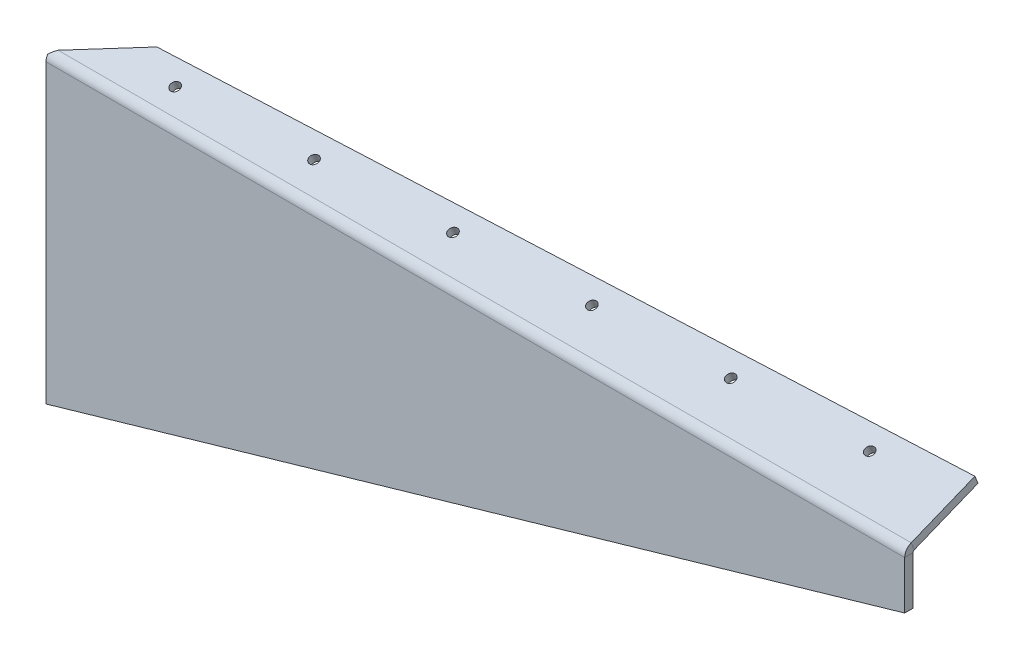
ISO-10303-21;
HEADER;
FILE_DESCRIPTION(('STEP AP214'),'2;1');
FILE_NAME('part.step','',(''),(''),'','','');
FILE_SCHEMA(('AUTOMOTIVE_DESIGN { 1 0 10303 214 1 1 1 1 }'));
ENDSEC;
DATA;
#1=APPLICATION_CONTEXT('core data for automotive mechanical design processes');
#2=APPLICATION_PROTOCOL_DEFINITION('international standard','automotive_design',2000,#1);
#3=PRODUCT_CONTEXT('',#1,'mechanical');
#4=PRODUCT('Part','Part','',(#3));
#5=PRODUCT_RELATED_PRODUCT_CATEGORY('part','',(#4));
#6=PRODUCT_DEFINITION_FORMATION('','',#4);
#7=PRODUCT_DEFINITION_CONTEXT('part definition',#1,'design');
#8=PRODUCT_DEFINITION('design','',#6,#7);
#9=PRODUCT_DEFINITION_SHAPE('','',#8);
#10=(LENGTH_UNIT() NAMED_UNIT(*) SI_UNIT(.MILLI.,.METRE.));
#11=(NAMED_UNIT(*) PLANE_ANGLE_UNIT() SI_UNIT($,.RADIAN.));
#12=(NAMED_UNIT(*) SI_UNIT($,.STERADIAN.) SOLID_ANGLE_UNIT());
#13=UNCERTAINTY_MEASURE_WITH_UNIT(LENGTH_MEASURE(1.E-05),#10,'distance_accuracy_value','');
#14=(GEOMETRIC_REPRESENTATION_CONTEXT(3) GLOBAL_UNCERTAINTY_ASSIGNED_CONTEXT((#13)) GLOBAL_UNIT_ASSIGNED_CONTEXT((#10,
#11,#12)) REPRESENTATION_CONTEXT('',''));
#15=CARTESIAN_POINT('',(0.,0.,0.));
#16=DIRECTION('',(0.,0.,1.));
#17=DIRECTION('',(1.,0.,0.));
#18=AXIS2_PLACEMENT_3D('',#15,#16,#17);
#19=CARTESIAN_POINT('',(830.,-21.770209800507,48.4096177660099));
#20=DIRECTION('',(0.,-0.927183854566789,-0.37460659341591));
#21=DIRECTION('',(-1.,0.,0.));
#22=AXIS2_PLACEMENT_3D('',#19,#20,#21);
#23=PLANE('',#22);
#24=CARTESIAN_POINT('',(749.575825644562,14.5966140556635,-41.6014298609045));
#25=DIRECTION('',(0.,-0.927183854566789,-0.37460659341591));
#26=DIRECTION('',(0.,0.37460659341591,-0.927183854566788));
#27=AXIS2_PLACEMENT_3D('',#24,#25,#26);
#28=CIRCLE('',#27,4.5);
#29=CARTESIAN_POINT('',(749.575825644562,16.2823437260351,-45.7737572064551));
#30=VERTEX_POINT('',#29);
#31=EDGE_CURVE('E462',#30,#30,#28,.T.);
#32=ORIENTED_EDGE('',*,*,#31,.F.);
#33=EDGE_LOOP('',(#32));
#34=FACE_BOUND('',#33,.T.);
#35=CARTESIAN_POINT('',(619.66066051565,12.8375630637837,-37.247625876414));
#36=DIRECTION('',(0.,-0.927183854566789,-0.37460659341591));
#37=DIRECTION('',(0.,0.37460659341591,-0.927183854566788));
#38=AXIS2_PLACEMENT_3D('',#35,#36,#37);
#39=CIRCLE('',#38,4.5);
#40=CARTESIAN_POINT('',(619.66066051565,14.5232927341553,-41.4199532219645));
#41=VERTEX_POINT('',#40);
#42=EDGE_CURVE('E472',#41,#41,#39,.T.);
#43=ORIENTED_EDGE('',*,*,#42,.F.);
#44=EDGE_LOOP('',(#43));
#45=FACE_BOUND('',#44,.T.);
#46=CARTESIAN_POINT('',(489.745495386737,11.078512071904,-32.8938218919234));
#47=DIRECTION('',(0.,-0.927183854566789,-0.37460659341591));
#48=DIRECTION('',(0.,0.37460659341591,-0.927183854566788));
#49=AXIS2_PLACEMENT_3D('',#46,#47,#48);
#50=CIRCLE('',#49,4.5);
#51=CARTESIAN_POINT('',(489.745495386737,12.7642417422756,-37.0661492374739));
#52=VERTEX_POINT('',#51);
#53=EDGE_CURVE('E478',#52,#52,#50,.T.);
#54=ORIENTED_EDGE('',*,*,#53,.F.);
#55=EDGE_LOOP('',(#54));
#56=FACE_BOUND('',#55,.T.);
#57=CARTESIAN_POINT('',(359.830330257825,9.31946108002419,-28.5400179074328));
#58=DIRECTION('',(0.,-0.927183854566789,-0.37460659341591));
#59=DIRECTION('',(0.,0.37460659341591,-0.927183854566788));
#60=AXIS2_PLACEMENT_3D('',#57,#58,#59);
#61=CIRCLE('',#60,4.5);
#62=CARTESIAN_POINT('',(359.830330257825,11.0051907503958,-32.7123452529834));
#63=VERTEX_POINT('',#62);
#64=EDGE_CURVE('E484',#63,#63,#61,.T.);
#65=ORIENTED_EDGE('',*,*,#64,.F.);
#66=EDGE_LOOP('',(#65));
#67=FACE_BOUND('',#66,.T.);
#68=CARTESIAN_POINT('',(229.915165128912,7.5604100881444,-24.1862139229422));
#69=DIRECTION('',(0.,-0.927183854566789,-0.37460659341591));
#70=DIRECTION('',(0.,0.37460659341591,-0.927183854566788));
#71=AXIS2_PLACEMENT_3D('',#68,#69,#70);
#72=CIRCLE('',#71,4.5);
#73=CARTESIAN_POINT('',(229.915165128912,9.246139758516,-28.3585412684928));
#74=VERTEX_POINT('',#73);
#75=EDGE_CURVE('E490',#74,#74,#72,.T.);
#76=ORIENTED_EDGE('',*,*,#75,.F.);
#77=EDGE_LOOP('',(#76));
#78=FACE_BOUND('',#77,.T.);
#79=CARTESIAN_POINT('',(100.,5.80135909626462,-19.8324099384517));
#80=DIRECTION('',(0.,-0.927183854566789,-0.37460659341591));
#81=DIRECTION('',(0.,0.37460659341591,-0.927183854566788));
#82=AXIS2_PLACEMENT_3D('',#79,#80,#81);
#83=CIRCLE('',#82,4.5);
#84=CARTESIAN_POINT('',(100.,7.48708876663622,-24.0047372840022));
#85=VERTEX_POINT('',#84);
#86=EDGE_CURVE('E301',#85,#85,#83,.T.);
#87=ORIENTED_EDGE('',*,*,#86,.F.);
#88=EDGE_LOOP('',(#87));
#89=FACE_BOUND('',#88,.T.);
#90=DIRECTION('',(0.,0.37460659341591,-0.927183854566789));
#91=VECTOR('',#90,1.);
#92=CARTESIAN_POINT('',(830.,23.1825814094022,-62.8524447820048));
#93=LINE('',#92,#91);
#94=CARTESIAN_POINT('',(830.,-1.70610396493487,-1.2507868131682));
#95=VERTEX_POINT('',#94);
#96=CARTESIAN_POINT('',(830.,23.1825814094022,-62.8524447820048));
#97=VERTEX_POINT('',#96);
#98=EDGE_CURVE('E72',#95,#97,#93,.T.);
#99=ORIENTED_EDGE('',*,*,#98,.F.);
#100=DIRECTION('',(-1.,0.,0.));
#101=VECTOR('',#100,1.);
#102=CARTESIAN_POINT('',(830.,-1.70610396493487,-1.2507868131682));
#103=LINE('',#102,#101);
#104=CARTESIAN_POINT('',(5.46142375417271,-1.70610396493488,-1.25078681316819));
#105=VERTEX_POINT('',#104);
#106=EDGE_CURVE('E64',#95,#105,#103,.T.);
#107=ORIENTED_EDGE('',*,*,#106,.T.);
#108=DIRECTION('',(-0.837703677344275,-0.204582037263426,0.506358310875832));
#109=VECTOR('',#108,1.);
#110=CARTESIAN_POINT('',(64.9575825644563,12.8239091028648,-37.2138311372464));
#111=LINE('',#110,#109);
#112=CARTESIAN_POINT('',(64.9575825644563,12.8239091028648,-37.2138311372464));
#113=VERTEX_POINT('',#112);
#114=EDGE_CURVE('E80',#113,#105,#111,.T.);
#115=ORIENTED_EDGE('',*,*,#114,.F.);
#116=DIRECTION('',(-0.999347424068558,-0.0135311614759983,0.0334907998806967));
#117=VECTOR('',#116,1.);
#118=CARTESIAN_POINT('',(830.,23.1825814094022,-62.8524447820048));
#119=LINE('',#118,#117);
#120=EDGE_CURVE('E191',#97,#113,#119,.T.);
#121=ORIENTED_EDGE('',*,*,#120,.F.);
#122=EDGE_LOOP('',(#99,#107,#115,#121));
#123=FACE_BOUND('',#122,.T.);
#124=ADVANCED_FACE('F53',(#34,#45,#56,#67,#78,#89,#123),#23,.T.);
#125=CARTESIAN_POINT('',(830.,30.6000522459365,-59.8555920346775));
#126=DIRECTION('',(-1.,0.,0.));
#127=DIRECTION('',(0.,0.927183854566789,0.37460659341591));
#128=AXIS2_PLACEMENT_3D('',#125,#126,#127);
#129=PLANE('',#128);
#130=DIRECTION('',(0.,0.927183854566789,0.37460659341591));
#131=VECTOR('',#130,1.);
#132=CARTESIAN_POINT('',(830.,5.71136687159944,1.74606593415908));
#133=LINE('',#132,#131);
#134=CARTESIAN_POINT('',(830.,5.71136687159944,1.74606593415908));
#135=VERTEX_POINT('',#134);
#136=EDGE_CURVE('E12',#95,#135,#133,.T.);
#137=ORIENTED_EDGE('',*,*,#136,.F.);
#138=ORIENTED_EDGE('',*,*,#98,.T.);
#139=DIRECTION('',(0.,-0.927183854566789,-0.37460659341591));
#140=VECTOR('',#139,1.);
#141=CARTESIAN_POINT('',(830.,30.6000522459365,-59.8555920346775));
#142=LINE('',#141,#140);
#143=CARTESIAN_POINT('',(830.,30.6000522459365,-59.8555920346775));
#144=VERTEX_POINT('',#143);
#145=EDGE_CURVE('E195',#144,#97,#142,.T.);
#146=ORIENTED_EDGE('',*,*,#145,.F.);
#147=DIRECTION('',(0.,0.37460659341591,-0.927183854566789));
#148=VECTOR('',#147,1.);
#149=CARTESIAN_POINT('',(830.,30.6000522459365,-59.8555920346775));
#150=LINE('',#149,#148);
#151=EDGE_CURVE('E190',#135,#144,#150,.T.);
#152=ORIENTED_EDGE('',*,*,#151,.F.);
#153=EDGE_LOOP('',(#137,#138,#146,#152));
#154=FACE_BOUND('',#153,.T.);
#155=ADVANCED_FACE('F55',(#154),#129,.F.);
#156=CARTESIAN_POINT('',(830.,30.6000522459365,-59.8555920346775));
#157=DIRECTION('',(0.0361209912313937,-0.374362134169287,0.926578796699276));
#158=DIRECTION('',(0.999347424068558,0.0135311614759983,-0.0334907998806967));
#159=AXIS2_PLACEMENT_3D('',#156,#157,#158);
#160=PLANE('',#159);
#161=ORIENTED_EDGE('',*,*,#120,.T.);
#162=DIRECTION('',(0.,-0.927183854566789,-0.37460659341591));
#163=VECTOR('',#162,1.);
#164=CARTESIAN_POINT('',(64.9575825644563,20.2413799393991,-34.2169783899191));
#165=LINE('',#164,#163);
#166=CARTESIAN_POINT('',(64.9575825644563,20.2413799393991,-34.2169783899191));
#167=VERTEX_POINT('',#166);
#168=EDGE_CURVE('E193',#167,#113,#165,.T.);
#169=ORIENTED_EDGE('',*,*,#168,.F.);
#170=DIRECTION('',(-0.999347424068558,-0.0135311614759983,0.0334907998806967));
#171=VECTOR('',#170,1.);
#172=CARTESIAN_POINT('',(830.,30.6000522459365,-59.8555920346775));
#173=LINE('',#172,#171);
#174=EDGE_CURVE('E187',#144,#167,#173,.T.);
#175=ORIENTED_EDGE('',*,*,#174,.F.);
#176=ORIENTED_EDGE('',*,*,#145,.T.);
#177=EDGE_LOOP('',(#161,#169,#175,#176));
#178=FACE_BOUND('',#177,.T.);
#179=ADVANCED_FACE('F337',(#178),#160,.F.);
#180=CARTESIAN_POINT('',(64.9575825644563,20.2413799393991,-34.2169783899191));
#181=DIRECTION('',(0.546125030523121,-0.313809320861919,0.776705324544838));
#182=DIRECTION('',(0.837703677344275,0.204582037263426,-0.506358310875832));
#183=AXIS2_PLACEMENT_3D('',#180,#181,#182);
#184=PLANE('',#183);
#185=CARTESIAN_POINT('',(5.46142375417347,5.71136687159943,1.74606593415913));
#186=CARTESIAN_POINT('',(5.46142375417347,-1.70610396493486,-1.25078681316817));
#187=B_SPLINE_CURVE_WITH_KNOTS('',1,(#185,#186),.UNSPECIFIED.,.F.,.F.,(2,2),(0.,1.),.UNSPECIFIED.);
#188=CARTESIAN_POINT('',(5.46142375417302,5.71136687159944,1.74606593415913));
#189=VERTEX_POINT('',#188);
#190=EDGE_CURVE('E206',#189,#105,#187,.T.);
#191=ORIENTED_EDGE('',*,*,#190,.F.);
#192=DIRECTION('',(-0.837703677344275,-0.204582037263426,0.506358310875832));
#193=VECTOR('',#192,1.);
#194=CARTESIAN_POINT('',(64.9575825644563,20.2413799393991,-34.2169783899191));
#195=LINE('',#194,#193);
#196=EDGE_CURVE('E189',#167,#189,#195,.T.);
#197=ORIENTED_EDGE('',*,*,#196,.F.);
#198=ORIENTED_EDGE('',*,*,#168,.T.);
#199=ORIENTED_EDGE('',*,*,#114,.T.);
#200=EDGE_LOOP('',(#191,#197,#198,#199));
#201=FACE_BOUND('',#200,.T.);
#202=ADVANCED_FACE('F216',(#201),#184,.F.);
#203=CARTESIAN_POINT('',(830.,-14.3527389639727,51.4064705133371));
#204=DIRECTION('',(0.,-0.927183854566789,-0.37460659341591));
#205=DIRECTION('',(-1.,0.,0.));
#206=AXIS2_PLACEMENT_3D('',#203,#204,#205);
#207=PLANE('',#206);
#208=CARTESIAN_POINT('',(749.575825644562,22.0140848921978,-38.6045771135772));
#209=DIRECTION('',(0.,0.927183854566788,0.37460659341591));
#210=DIRECTION('',(0.,-0.37460659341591,0.927183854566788));
#211=AXIS2_PLACEMENT_3D('',#208,#209,#210);
#212=CIRCLE('',#211,4.5);
#213=CARTESIAN_POINT('',(749.575825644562,20.3283552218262,-34.4322497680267));
#214=VERTEX_POINT('',#213);
#215=EDGE_CURVE('E465',#214,#214,#212,.T.);
#216=ORIENTED_EDGE('',*,*,#215,.F.);
#217=EDGE_LOOP('',(#216));
#218=FACE_BOUND('',#217,.T.);
#219=CARTESIAN_POINT('',(619.66066051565,20.2550339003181,-34.2507731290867));
#220=DIRECTION('',(0.,0.927183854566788,0.37460659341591));
#221=DIRECTION('',(0.,-0.37460659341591,0.927183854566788));
#222=AXIS2_PLACEMENT_3D('',#219,#220,#221);
#223=CIRCLE('',#222,4.5);
#224=CARTESIAN_POINT('',(619.66066051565,18.5693042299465,-30.0784457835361));
#225=VERTEX_POINT('',#224);
#226=EDGE_CURVE('E467',#225,#225,#223,.T.);
#227=ORIENTED_EDGE('',*,*,#226,.F.);
#228=EDGE_LOOP('',(#227));
#229=FACE_BOUND('',#228,.T.);
#230=CARTESIAN_POINT('',(489.745495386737,18.4959829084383,-29.8969691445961));
#231=DIRECTION('',(0.,0.927183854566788,0.37460659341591));
#232=DIRECTION('',(0.,-0.37460659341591,0.927183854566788));
#233=AXIS2_PLACEMENT_3D('',#230,#231,#232);
#234=CIRCLE('',#233,4.5);
#235=CARTESIAN_POINT('',(489.745495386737,16.8102532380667,-25.7246417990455));
#236=VERTEX_POINT('',#235);
#237=EDGE_CURVE('E475',#236,#236,#234,.T.);
#238=ORIENTED_EDGE('',*,*,#237,.F.);
#239=EDGE_LOOP('',(#238));
#240=FACE_BOUND('',#239,.T.);
#241=CARTESIAN_POINT('',(359.830330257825,16.7369319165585,-25.5431651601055));
#242=DIRECTION('',(0.,0.927183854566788,0.37460659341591));
#243=DIRECTION('',(0.,-0.37460659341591,0.927183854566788));
#244=AXIS2_PLACEMENT_3D('',#241,#242,#243);
#245=CIRCLE('',#244,4.5);
#246=CARTESIAN_POINT('',(359.830330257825,15.0512022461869,-21.370837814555));
#247=VERTEX_POINT('',#246);
#248=EDGE_CURVE('E481',#247,#247,#245,.T.);
#249=ORIENTED_EDGE('',*,*,#248,.F.);
#250=EDGE_LOOP('',(#249));
#251=FACE_BOUND('',#250,.T.);
#252=CARTESIAN_POINT('',(229.915165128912,14.9778809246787,-21.1893611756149));
#253=DIRECTION('',(0.,0.927183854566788,0.37460659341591));
#254=DIRECTION('',(0.,-0.37460659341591,0.927183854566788));
#255=AXIS2_PLACEMENT_3D('',#252,#253,#254);
#256=CIRCLE('',#255,4.5);
#257=CARTESIAN_POINT('',(229.915165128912,13.2921512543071,-17.0170338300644));
#258=VERTEX_POINT('',#257);
#259=EDGE_CURVE('E487',#258,#258,#256,.T.);
#260=ORIENTED_EDGE('',*,*,#259,.F.);
#261=EDGE_LOOP('',(#260));
#262=FACE_BOUND('',#261,.T.);
#263=CARTESIAN_POINT('',(100.,13.2188299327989,-16.8355571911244));
#264=DIRECTION('',(0.,0.927183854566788,0.37460659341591));
#265=DIRECTION('',(0.,-0.37460659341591,0.927183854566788));
#266=AXIS2_PLACEMENT_3D('',#263,#264,#265);
#267=CIRCLE('',#266,4.5);
#268=CARTESIAN_POINT('',(100.,11.5331002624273,-12.6632298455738));
#269=VERTEX_POINT('',#268);
#270=EDGE_CURVE('E304',#269,#269,#267,.T.);
#271=ORIENTED_EDGE('',*,*,#270,.F.);
#272=EDGE_LOOP('',(#271));
#273=FACE_BOUND('',#272,.T.);
#274=DIRECTION('',(-1.,0.,0.));
#275=VECTOR('',#274,1.);
#276=CARTESIAN_POINT('',(830.,5.71136687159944,1.74606593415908));
#277=LINE('',#276,#275);
#278=EDGE_CURVE('E197',#135,#189,#277,.T.);
#279=ORIENTED_EDGE('',*,*,#278,.F.);
#280=ORIENTED_EDGE('',*,*,#151,.T.);
#281=ORIENTED_EDGE('',*,*,#174,.T.);
#282=ORIENTED_EDGE('',*,*,#196,.T.);
#283=EDGE_LOOP('',(#279,#280,#281,#282));
#284=FACE_BOUND('',#283,.T.);
#285=ADVANCED_FACE('F223',(#218,#229,#240,#251,#262,#273,#284),#207,.F.);
#286=CARTESIAN_POINT('',(0.,-290.,8.));
#287=DIRECTION('',(-0.277777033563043,0.960645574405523,0.));
#288=DIRECTION('',(-0.960645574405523,-0.277777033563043,0.));
#289=AXIS2_PLACEMENT_3D('',#286,#287,#288);
#290=PLANE('',#289);
#291=DIRECTION('',(0.960645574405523,0.277777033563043,0.));
#292=VECTOR('',#291,1.);
#293=CARTESIAN_POINT('',(0.,-290.,0.));
#294=LINE('',#293,#292);
#295=CARTESIAN_POINT('',(0.,-290.,0.));
#296=VERTEX_POINT('',#295);
#297=CARTESIAN_POINT('',(830.,-50.,0.));
#298=VERTEX_POINT('',#297);
#299=EDGE_CURVE('E181',#296,#298,#294,.T.);
#300=ORIENTED_EDGE('',*,*,#299,.T.);
#301=DIRECTION('',(0.,0.,-1.));
#302=VECTOR('',#301,1.);
#303=CARTESIAN_POINT('',(830.,-50.,8.));
#304=LINE('',#303,#302);
#305=CARTESIAN_POINT('',(830.,-50.,8.));
#306=VERTEX_POINT('',#305);
#307=EDGE_CURVE('E166',#306,#298,#304,.T.);
#308=ORIENTED_EDGE('',*,*,#307,.F.);
#309=DIRECTION('',(0.960645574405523,0.277777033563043,0.));
#310=VECTOR('',#309,1.);
#311=CARTESIAN_POINT('',(0.,-290.,8.));
#312=LINE('',#311,#310);
#313=CARTESIAN_POINT('',(0.,-290.,8.));
#314=VERTEX_POINT('',#313);
#315=EDGE_CURVE('E156',#314,#306,#312,.T.);
#316=ORIENTED_EDGE('',*,*,#315,.F.);
#317=DIRECTION('',(0.,0.,-1.));
#318=VECTOR('',#317,1.);
#319=CARTESIAN_POINT('',(0.,-290.,8.));
#320=LINE('',#319,#318);
#321=EDGE_CURVE('E160',#314,#296,#320,.T.);
#322=ORIENTED_EDGE('',*,*,#321,.T.);
#323=EDGE_LOOP('',(#300,#308,#316,#322));
#324=FACE_BOUND('',#323,.T.);
#325=ADVANCED_FACE('F345',(#324),#290,.F.);
#326=CARTESIAN_POINT('',(830.,-50.,8.));
#327=DIRECTION('',(0.,0.,-1.));
#328=DIRECTION('',(-1.,0.,0.));
#329=AXIS2_PLACEMENT_3D('',#326,#327,#328);
#330=PLANE('',#329);
#331=DIRECTION('',(0.,1.,0.));
#332=VECTOR('',#331,1.);
#333=CARTESIAN_POINT('',(830.,70.,8.));
#334=LINE('',#333,#332);
#335=CARTESIAN_POINT('',(830.,-3.56047167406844,8.));
#336=VERTEX_POINT('',#335);
#337=EDGE_CURVE('E151',#306,#336,#334,.T.);
#338=ORIENTED_EDGE('',*,*,#337,.T.);
#339=DIRECTION('',(-1.,0.,0.));
#340=VECTOR('',#339,1.);
#341=CARTESIAN_POINT('',(830.,-3.56047167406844,8.));
#342=LINE('',#341,#340);
#343=CARTESIAN_POINT('',(4.44089209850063E-13,-3.56047167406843,8.));
#344=VERTEX_POINT('',#343);
#345=EDGE_CURVE('E142',#336,#344,#342,.T.);
#346=ORIENTED_EDGE('',*,*,#345,.T.);
#347=DIRECTION('',(0.,-1.,0.));
#348=VECTOR('',#347,1.);
#349=CARTESIAN_POINT('',(0.,0.,8.));
#350=LINE('',#349,#348);
#351=EDGE_CURVE('E150',#344,#314,#350,.T.);
#352=ORIENTED_EDGE('',*,*,#351,.T.);
#353=ORIENTED_EDGE('',*,*,#315,.T.);
#354=EDGE_LOOP('',(#338,#346,#352,#353));
#355=FACE_BOUND('',#354,.T.);
#356=ADVANCED_FACE('F154',(#355),#330,.F.);
#357=CARTESIAN_POINT('',(0.,0.,8.));
#358=DIRECTION('',(1.,0.,0.));
#359=DIRECTION('',(0.,1.,0.));
#360=AXIS2_PLACEMENT_3D('',#357,#358,#359);
#361=PLANE('',#360);
#362=ORIENTED_EDGE('',*,*,#351,.F.);
#363=DIRECTION('',(0.,0.,-1.));
#364=VECTOR('',#363,1.);
#365=CARTESIAN_POINT('',(0.,-3.56047167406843,8.));
#366=LINE('',#365,#364);
#367=CARTESIAN_POINT('',(0.,-3.56047167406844,0.));
#368=VERTEX_POINT('',#367);
#369=EDGE_CURVE('E174',#344,#368,#366,.T.);
#370=ORIENTED_EDGE('',*,*,#369,.T.);
#371=DIRECTION('',(0.,-1.,0.));
#372=VECTOR('',#371,1.);
#373=CARTESIAN_POINT('',(0.,0.,0.));
#374=LINE('',#373,#372);
#375=EDGE_CURVE('E169',#368,#296,#374,.T.);
#376=ORIENTED_EDGE('',*,*,#375,.T.);
#377=ORIENTED_EDGE('',*,*,#321,.F.);
#378=EDGE_LOOP('',(#362,#370,#376,#377));
#379=FACE_BOUND('',#378,.T.);
#380=ADVANCED_FACE('F355',(#379),#361,.F.);
#381=CARTESIAN_POINT('',(830.,-50.,0.));
#382=DIRECTION('',(0.,0.,-1.));
#383=DIRECTION('',(-1.,0.,0.));
#384=AXIS2_PLACEMENT_3D('',#381,#382,#383);
#385=PLANE('',#384);
#386=DIRECTION('',(-1.,0.,0.));
#387=VECTOR('',#386,1.);
#388=CARTESIAN_POINT('',(830.,-3.56047167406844,0.));
#389=LINE('',#388,#387);
#390=CARTESIAN_POINT('',(830.,-3.56047167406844,0.));
#391=VERTEX_POINT('',#390);
#392=EDGE_CURVE('E184',#391,#368,#389,.T.);
#393=ORIENTED_EDGE('',*,*,#392,.F.);
#394=DIRECTION('',(0.,1.,0.));
#395=VECTOR('',#394,1.);
#396=CARTESIAN_POINT('',(830.,70.,0.));
#397=LINE('',#396,#395);
#398=EDGE_CURVE('E164',#298,#391,#397,.T.);
#399=ORIENTED_EDGE('',*,*,#398,.F.);
#400=ORIENTED_EDGE('',*,*,#299,.F.);
#401=ORIENTED_EDGE('',*,*,#375,.F.);
#402=EDGE_LOOP('',(#393,#399,#400,#401));
#403=FACE_BOUND('',#402,.T.);
#404=ADVANCED_FACE('F352',(#403),#385,.T.);
#405=CARTESIAN_POINT('',(830.,70.,8.));
#406=DIRECTION('',(-1.,0.,0.));
#407=DIRECTION('',(0.,0.,1.));
#408=AXIS2_PLACEMENT_3D('',#405,#406,#407);
#409=PLANE('',#408);
#410=ORIENTED_EDGE('',*,*,#398,.T.);
#411=DIRECTION('',(0.,0.,1.));
#412=VECTOR('',#411,1.);
#413=CARTESIAN_POINT('',(830.,-3.56047167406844,8.));
#414=LINE('',#413,#412);
#415=EDGE_CURVE('E133',#391,#336,#414,.T.);
#416=ORIENTED_EDGE('',*,*,#415,.T.);
#417=ORIENTED_EDGE('',*,*,#337,.F.);
#418=ORIENTED_EDGE('',*,*,#307,.T.);
#419=EDGE_LOOP('',(#410,#416,#417,#418));
#420=FACE_BOUND('',#419,.T.);
#421=ADVANCED_FACE('F163',(#420),#409,.F.);
#422=CARTESIAN_POINT('',(830.,-3.56047167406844,-2.));
#423=DIRECTION('',(1.,0.,0.));
#424=DIRECTION('',(0.,0.,-1.));
#425=AXIS2_PLACEMENT_3D('',#422,#423,#424);
#426=PLANE('',#425);
#427=ORIENTED_EDGE('',*,*,#415,.F.);
#428=CARTESIAN_POINT('',(830.,-3.56047167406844,-2.));
#429=DIRECTION('',(-1.,0.,0.));
#430=DIRECTION('',(0.,0.,1.));
#431=AXIS2_PLACEMENT_3D('',#428,#429,#430);
#432=CIRCLE('',#431,2.);
#433=EDGE_CURVE('E300',#391,#95,#432,.T.);
#434=ORIENTED_EDGE('',*,*,#433,.T.);
#435=ORIENTED_EDGE('',*,*,#136,.T.);
#436=CARTESIAN_POINT('',(830.,-3.56047167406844,-2.));
#437=DIRECTION('',(-1.,0.,0.));
#438=DIRECTION('',(0.,0.,1.));
#439=AXIS2_PLACEMENT_3D('',#436,#437,#438);
#440=CIRCLE('',#439,10.);
#441=EDGE_CURVE('E128',#336,#135,#440,.T.);
#442=ORIENTED_EDGE('',*,*,#441,.F.);
#443=EDGE_LOOP('',(#427,#434,#435,#442));
#444=FACE_BOUND('',#443,.T.);
#445=ADVANCED_FACE('F130',(#444),#426,.T.);
#446=CARTESIAN_POINT('',(5.46142375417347,5.71136687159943,1.74606593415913));
#447=CARTESIAN_POINT('',(3.63807263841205,4.9692092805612,3.58297043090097));
#448=CARTESIAN_POINT('',(1.8233511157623,3.67391784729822,5.18252213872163));
#449=CARTESIAN_POINT('',(8.88178419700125E-13,2.03145736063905,6.29037572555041));
#450=CARTESIAN_POINT('',(5.46142375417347,-1.70610396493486,-1.25078681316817));
#451=CARTESIAN_POINT('',(3.64064964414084,-1.85432569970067,-0.883925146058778));
#452=CARTESIAN_POINT('',(1.82077411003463,-2.11405803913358,-0.563182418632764));
#453=CARTESIAN_POINT('',(8.88178419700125E-13,-2.44208586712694,-0.341924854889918));
#454=B_SPLINE_SURFACE_WITH_KNOTS('',1,3,((#446,#447,#448,#449),(#450,#451,#452,#453)),
.UNSPECIFIED.,.F.,.F.,.F.,(2,2),(4,4),(0.,1.),(0.,1.),.UNSPECIFIED.);
#455=CARTESIAN_POINT('',(5.46142375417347,-1.70610396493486,-1.25078681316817));
#456=CARTESIAN_POINT('',(3.64064964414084,-1.85432569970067,-0.883925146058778));
#457=CARTESIAN_POINT('',(1.82077411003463,-2.11405803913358,-0.563182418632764));
#458=CARTESIAN_POINT('',(8.88178419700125E-13,-2.44208586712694,-0.341924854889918));
#459=B_SPLINE_CURVE_WITH_KNOTS('',3,(#455,#456,#457,#458),.UNSPECIFIED.,.F.,.F.,(4,4),(0.,1.),.UNSPECIFIED.);
#460=CARTESIAN_POINT('',(1.33226762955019E-12,-2.44208586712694,-0.341924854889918));
#461=VERTEX_POINT('',#460);
#462=EDGE_CURVE('E298',#105,#461,#459,.T.);
#463=CARTESIAN_POINT('',(8.88178419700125E-13,-2.44208586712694,-0.341924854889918));
#464=CARTESIAN_POINT('',(8.88178419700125E-13,2.03145736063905,6.29037572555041));
#465=B_SPLINE_CURVE_WITH_KNOTS('',1,(#463,#464),.UNSPECIFIED.,.F.,.F.,(2,2),(0.,1.),.UNSPECIFIED.);
#466=CARTESIAN_POINT('',(8.88178419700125E-13,2.03145736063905,6.29037572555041));
#467=VERTEX_POINT('',#466);
#468=EDGE_CURVE('E186',#461,#467,#465,.T.);
#469=CARTESIAN_POINT('',(8.88178419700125E-13,2.03145736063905,6.29037572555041));
#470=CARTESIAN_POINT('',(1.8233511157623,3.67391784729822,5.18252213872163));
#471=CARTESIAN_POINT('',(3.63807263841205,4.9692092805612,3.58297043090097));
#472=CARTESIAN_POINT('',(5.46142375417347,5.71136687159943,1.74606593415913));
#473=B_SPLINE_CURVE_WITH_KNOTS('',3,(#469,#470,#471,#472),.UNSPECIFIED.,.F.,.F.,(4,4),(0.,1.),.UNSPECIFIED.);
#474=EDGE_CURVE('E137',#189,#467,#473,.F.);
#475=ORIENTED_EDGE('',*,*,#190,.T.);
#476=ORIENTED_EDGE('',*,*,#462,.T.);
#477=ORIENTED_EDGE('',*,*,#468,.T.);
#478=ORIENTED_EDGE('',*,*,#474,.F.);
#479=EDGE_LOOP('',(#475,#476,#477,#478));
#480=FACE_BOUND('',#479,.T.);
#481=ADVANCED_FACE('F229',(#480),#454,.T.);
#482=CARTESIAN_POINT('',(4.44089209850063E-13,-3.56047167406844,-2.));
#483=DIRECTION('',(-1.,0.,0.));
#484=DIRECTION('',(0.,0.,1.));
#485=AXIS2_PLACEMENT_3D('',#482,#483,#484);
#486=PLANE('',#485);
#487=ORIENTED_EDGE('',*,*,#468,.F.);
#488=CARTESIAN_POINT('',(1.33226762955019E-12,-3.56047167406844,-2.));
#489=DIRECTION('',(-1.,0.,0.));
#490=DIRECTION('',(0.,0.,1.));
#491=AXIS2_PLACEMENT_3D('',#488,#489,#490);
#492=CIRCLE('',#491,2.);
#493=EDGE_CURVE('E138',#461,#368,#492,.F.);
#494=ORIENTED_EDGE('',*,*,#493,.T.);
#495=ORIENTED_EDGE('',*,*,#369,.F.);
#496=CARTESIAN_POINT('',(4.44089209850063E-13,-3.56047167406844,-2.));
#497=DIRECTION('',(1.,0.,0.));
#498=DIRECTION('',(0.,0.,-1.));
#499=AXIS2_PLACEMENT_3D('',#496,#497,#498);
#500=CIRCLE('',#499,10.);
#501=EDGE_CURVE('E147',#467,#344,#500,.T.);
#502=ORIENTED_EDGE('',*,*,#501,.F.);
#503=EDGE_LOOP('',(#487,#494,#495,#502));
#504=FACE_BOUND('',#503,.T.);
#505=ADVANCED_FACE('F254',(#504),#486,.T.);
#506=CARTESIAN_POINT('',(1245.06909822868,-3.56047167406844,-2.));
#507=DIRECTION('',(-1.,0.,0.));
#508=DIRECTION('',(0.,0.,1.));
#509=AXIS2_PLACEMENT_3D('',#506,#507,#508);
#510=CYLINDRICAL_SURFACE('',#509,10.);
#511=ORIENTED_EDGE('',*,*,#501,.T.);
#512=ORIENTED_EDGE('',*,*,#345,.F.);
#513=ORIENTED_EDGE('',*,*,#441,.T.);
#514=ORIENTED_EDGE('',*,*,#278,.T.);
#515=ORIENTED_EDGE('',*,*,#474,.T.);
#516=EDGE_LOOP('',(#511,#512,#513,#514,#515));
#517=FACE_BOUND('',#516,.T.);
#518=ADVANCED_FACE('F144',(#517),#510,.T.);
#519=CARTESIAN_POINT('',(1245.06909822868,-3.56047167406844,-2.));
#520=DIRECTION('',(-1.,0.,0.));
#521=DIRECTION('',(0.,0.,1.));
#522=AXIS2_PLACEMENT_3D('',#519,#520,#521);
#523=CYLINDRICAL_SURFACE('',#522,2.);
#524=ORIENTED_EDGE('',*,*,#493,.F.);
#525=ORIENTED_EDGE('',*,*,#462,.F.);
#526=ORIENTED_EDGE('',*,*,#106,.F.);
#527=ORIENTED_EDGE('',*,*,#433,.F.);
#528=ORIENTED_EDGE('',*,*,#392,.T.);
#529=EDGE_LOOP('',(#524,#525,#526,#527,#528));
#530=FACE_BOUND('',#529,.T.);
#531=ADVANCED_FACE('F296',(#530),#523,.F.);
#532=CARTESIAN_POINT('',(100.,3.94699138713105,-20.5816231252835));
#533=DIRECTION('',(0.,0.927183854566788,0.37460659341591));
#534=DIRECTION('',(0.,-0.37460659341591,0.927183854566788));
#535=AXIS2_PLACEMENT_3D('',#532,#533,#534);
#536=CYLINDRICAL_SURFACE('',#535,4.5);
#537=ORIENTED_EDGE('',*,*,#86,.T.);
#538=EDGE_LOOP('',(#537));
#539=FACE_BOUND('',#538,.T.);
#540=ORIENTED_EDGE('',*,*,#270,.T.);
#541=EDGE_LOOP('',(#540));
#542=FACE_BOUND('',#541,.T.);
#543=ADVANCED_FACE('F322',(#539,#542),#536,.F.);
#544=CARTESIAN_POINT('',(229.915165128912,5.70604237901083,-24.935427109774));
#545=DIRECTION('',(0.,0.927183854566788,0.37460659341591));
#546=DIRECTION('',(0.,-0.37460659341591,0.927183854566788));
#547=AXIS2_PLACEMENT_3D('',#544,#545,#546);
#548=CYLINDRICAL_SURFACE('',#547,4.5);
#549=ORIENTED_EDGE('',*,*,#75,.T.);
#550=EDGE_LOOP('',(#549));
#551=FACE_BOUND('',#550,.T.);
#552=ORIENTED_EDGE('',*,*,#259,.T.);
#553=EDGE_LOOP('',(#552));
#554=FACE_BOUND('',#553,.T.);
#555=ADVANCED_FACE('F329',(#551,#554),#548,.F.);
#556=CARTESIAN_POINT('',(359.830330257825,7.46509337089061,-29.2892310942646));
#557=DIRECTION('',(0.,0.927183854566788,0.37460659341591));
#558=DIRECTION('',(0.,-0.37460659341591,0.927183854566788));
#559=AXIS2_PLACEMENT_3D('',#556,#557,#558);
#560=CYLINDRICAL_SURFACE('',#559,4.5);
#561=ORIENTED_EDGE('',*,*,#64,.T.);
#562=EDGE_LOOP('',(#561));
#563=FACE_BOUND('',#562,.T.);
#564=ORIENTED_EDGE('',*,*,#248,.T.);
#565=EDGE_LOOP('',(#564));
#566=FACE_BOUND('',#565,.T.);
#567=ADVANCED_FACE('F427',(#563,#566),#560,.F.);
#568=CARTESIAN_POINT('',(489.745495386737,9.2241443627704,-33.6430350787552));
#569=DIRECTION('',(0.,0.927183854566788,0.37460659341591));
#570=DIRECTION('',(0.,-0.37460659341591,0.927183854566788));
#571=AXIS2_PLACEMENT_3D('',#568,#569,#570);
#572=CYLINDRICAL_SURFACE('',#571,4.5);
#573=ORIENTED_EDGE('',*,*,#53,.T.);
#574=EDGE_LOOP('',(#573));
#575=FACE_BOUND('',#574,.T.);
#576=ORIENTED_EDGE('',*,*,#237,.T.);
#577=EDGE_LOOP('',(#576));
#578=FACE_BOUND('',#577,.T.);
#579=ADVANCED_FACE('F434',(#575,#578),#572,.F.);
#580=CARTESIAN_POINT('',(619.66066051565,10.9831953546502,-37.9968390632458));
#581=DIRECTION('',(0.,0.927183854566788,0.37460659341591));
#582=DIRECTION('',(0.,-0.37460659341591,0.927183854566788));
#583=AXIS2_PLACEMENT_3D('',#580,#581,#582);
#584=CYLINDRICAL_SURFACE('',#583,4.5);
#585=ORIENTED_EDGE('',*,*,#42,.T.);
#586=EDGE_LOOP('',(#585));
#587=FACE_BOUND('',#586,.T.);
#588=ORIENTED_EDGE('',*,*,#226,.T.);
#589=EDGE_LOOP('',(#588));
#590=FACE_BOUND('',#589,.T.);
#591=ADVANCED_FACE('F442',(#587,#590),#584,.F.);
#592=CARTESIAN_POINT('',(749.575825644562,12.74224634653,-42.3506430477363));
#593=DIRECTION('',(0.,0.927183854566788,0.37460659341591));
#594=DIRECTION('',(0.,-0.37460659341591,0.927183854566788));
#595=AXIS2_PLACEMENT_3D('',#592,#593,#594);
#596=CYLINDRICAL_SURFACE('',#595,4.5);
#597=ORIENTED_EDGE('',*,*,#31,.T.);
#598=EDGE_LOOP('',(#597));
#599=FACE_BOUND('',#598,.T.);
#600=ORIENTED_EDGE('',*,*,#215,.T.);
#601=EDGE_LOOP('',(#600));
#602=FACE_BOUND('',#601,.T.);
#603=ADVANCED_FACE('F450',(#599,#602),#596,.F.);
#604=CLOSED_SHELL('',(#124,#155,#179,#202,#285,#325,#356,#380,#404,#421,#445,#481,#505,#518,
#531,#543,#555,#567,#579,#591,#603));
#605=MANIFOLD_SOLID_BREP('B2',#604);
#606=ADVANCED_BREP_SHAPE_REPRESENTATION('',(#18,#605),#14);
#607=SHAPE_DEFINITION_REPRESENTATION(#9,#606);
ENDSEC;
END-ISO-10303-21;
